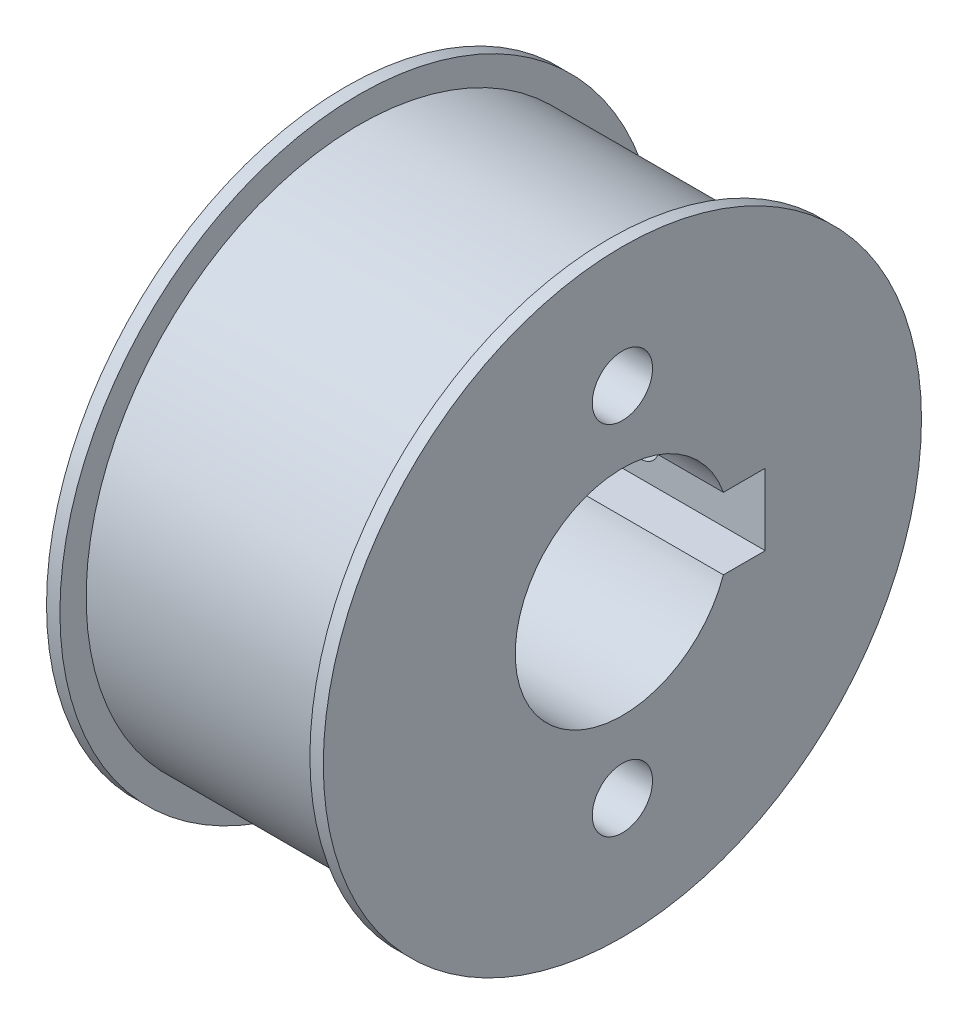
ISO-10303-21;
HEADER;
FILE_DESCRIPTION(('STEP AP214'),'2;1');
FILE_NAME('part.step','',(''),(''),'','','');
FILE_SCHEMA(('AUTOMOTIVE_DESIGN { 1 0 10303 214 1 1 1 1 }'));
ENDSEC;
DATA;
#1=APPLICATION_CONTEXT('core data for automotive mechanical design processes');
#2=APPLICATION_PROTOCOL_DEFINITION('international standard','automotive_design',2000,#1);
#3=PRODUCT_CONTEXT('',#1,'mechanical');
#4=PRODUCT('Part','Part','',(#3));
#5=PRODUCT_RELATED_PRODUCT_CATEGORY('part','',(#4));
#6=PRODUCT_DEFINITION_FORMATION('','',#4);
#7=PRODUCT_DEFINITION_CONTEXT('part definition',#1,'design');
#8=PRODUCT_DEFINITION('design','',#6,#7);
#9=PRODUCT_DEFINITION_SHAPE('','',#8);
#10=(LENGTH_UNIT() NAMED_UNIT(*) SI_UNIT(.MILLI.,.METRE.));
#11=(NAMED_UNIT(*) PLANE_ANGLE_UNIT() SI_UNIT($,.RADIAN.));
#12=(NAMED_UNIT(*) SI_UNIT($,.STERADIAN.) SOLID_ANGLE_UNIT());
#13=UNCERTAINTY_MEASURE_WITH_UNIT(LENGTH_MEASURE(1.E-05),#10,'distance_accuracy_value','');
#14=(GEOMETRIC_REPRESENTATION_CONTEXT(3) GLOBAL_UNCERTAINTY_ASSIGNED_CONTEXT((#13)) GLOBAL_UNIT_ASSIGNED_CONTEXT((#10,
#11,#12)) REPRESENTATION_CONTEXT('',''));
#15=CARTESIAN_POINT('',(0.,0.,0.));
#16=DIRECTION('',(0.,0.,1.));
#17=DIRECTION('',(1.,0.,0.));
#18=AXIS2_PLACEMENT_3D('',#15,#16,#17);
#19=CARTESIAN_POINT('',(-14.,0.,-35.));
#20=DIRECTION('',(0.,0.,1.));
#21=DIRECTION('',(1.,0.,0.));
#22=AXIS2_PLACEMENT_3D('',#19,#20,#21);
#23=CYLINDRICAL_SURFACE('',#22,2.1);
#24=CARTESIAN_POINT('',(-16.1,0.,-30.56));
#25=CARTESIAN_POINT('',(-16.0999948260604,-0.117808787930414,-30.5599990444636));
#26=CARTESIAN_POINT('',(-16.0900531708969,-0.235699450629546,-30.5593114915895));
#27=CARTESIAN_POINT('',(-16.0505376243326,-0.468223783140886,-30.5566348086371));
#28=CARTESIAN_POINT('',(-16.0209410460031,-0.582853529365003,-30.5546441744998));
#29=CARTESIAN_POINT('',(-15.9429713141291,-0.805454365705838,-30.5495864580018));
#30=CARTESIAN_POINT('',(-15.894608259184,-0.913429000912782,-30.5465199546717));
#31=CARTESIAN_POINT('',(-15.7804952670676,-1.11970013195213,-30.5396551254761));
#32=CARTESIAN_POINT('',(-15.7147492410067,-1.2179987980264,-30.5358569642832));
#33=CARTESIAN_POINT('',(-15.5676090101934,-1.40233025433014,-30.5279479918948));
#34=CARTESIAN_POINT('',(-15.4861903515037,-1.48834350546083,-30.5238366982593));
#35=CARTESIAN_POINT('',(-15.310066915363,-1.64549524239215,-30.5157689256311));
#36=CARTESIAN_POINT('',(-15.2153615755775,-1.71663309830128,-30.5118124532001));
#37=CARTESIAN_POINT('',(-15.0152397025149,-1.84207705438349,-30.5044966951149));
#38=CARTESIAN_POINT('',(-14.9098127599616,-1.89636658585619,-30.501137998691));
#39=CARTESIAN_POINT('',(-14.6913132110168,-1.9864668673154,-30.4954029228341));
#40=CARTESIAN_POINT('',(-14.5782407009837,-2.02227785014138,-30.4930265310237));
#41=CARTESIAN_POINT('',(-14.3478507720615,-2.07434937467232,-30.489528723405));
#42=CARTESIAN_POINT('',(-14.230540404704,-2.09064097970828,-30.488405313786));
#43=CARTESIAN_POINT('',(-13.9948451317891,-2.10330720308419,-30.4875341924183));
#44=CARTESIAN_POINT('',(-13.8764602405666,-2.09968208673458,-30.4877864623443));
#45=CARTESIAN_POINT('',(-13.6421884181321,-2.07264351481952,-30.4896364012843));
#46=CARTESIAN_POINT('',(-13.5262975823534,-2.04926371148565,-30.4912317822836));
#47=CARTESIAN_POINT('',(-13.30008915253,-1.98343165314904,-30.4955845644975));
#48=CARTESIAN_POINT('',(-13.1897715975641,-1.94097926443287,-30.4983419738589));
#49=CARTESIAN_POINT('',(-12.9777333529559,-1.83816903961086,-30.5047107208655));
#50=CARTESIAN_POINT('',(-12.876020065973,-1.77779598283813,-30.5083227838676));
#51=CARTESIAN_POINT('',(-12.6841585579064,-1.64086920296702,-30.5159930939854));
#52=CARTESIAN_POINT('',(-12.5940104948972,-1.56431525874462,-30.5200513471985));
#53=CARTESIAN_POINT('',(-12.4276426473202,-1.39701046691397,-30.5281668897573));
#54=CARTESIAN_POINT('',(-12.3514521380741,-1.30623050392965,-30.5322241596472));
#55=CARTESIAN_POINT('',(-12.2153881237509,-1.11315251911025,-30.5398724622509));
#56=CARTESIAN_POINT('',(-12.1555146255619,-1.01085449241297,-30.5434634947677));
#57=CARTESIAN_POINT('',(-12.0537865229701,-0.79762614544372,-30.5497750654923));
#58=CARTESIAN_POINT('',(-12.0119330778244,-0.686695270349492,-30.5524955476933));
#59=CARTESIAN_POINT('',(-11.9474529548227,-0.459358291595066,-30.556758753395));
#60=CARTESIAN_POINT('',(-11.9248260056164,-0.342952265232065,-30.5583014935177));
#61=CARTESIAN_POINT('',(-11.8994775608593,-0.108223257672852,-30.5600332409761));
#62=CARTESIAN_POINT('',(-11.8967155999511,0.0100953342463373,-30.560225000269));
#63=CARTESIAN_POINT('',(-11.9110697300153,0.245514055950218,-30.5592405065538));
#64=CARTESIAN_POINT('',(-11.9281856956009,0.362614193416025,-30.5580642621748));
#65=CARTESIAN_POINT('',(-11.9817763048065,0.59215759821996,-30.55447791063));
#66=CARTESIAN_POINT('',(-12.0182323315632,0.704605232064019,-30.5520689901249));
#67=CARTESIAN_POINT('',(-12.1094492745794,0.9217865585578,-30.5462881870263));
#68=CARTESIAN_POINT('',(-12.1642103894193,1.02652016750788,-30.5429162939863));
#69=CARTESIAN_POINT('',(-12.2905856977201,1.22548543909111,-30.5355813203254));
#70=CARTESIAN_POINT('',(-12.3622268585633,1.31969993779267,-30.5316172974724));
#71=CARTESIAN_POINT('',(-12.5202894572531,1.49477967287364,-30.5235471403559));
#72=CARTESIAN_POINT('',(-12.6067110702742,1.57564475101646,-30.5194410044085));
#73=CARTESIAN_POINT('',(-12.7920562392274,1.72186772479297,-30.5115413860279));
#74=CARTESIAN_POINT('',(-12.8910005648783,1.78719932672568,-30.5077484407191));
#75=CARTESIAN_POINT('',(-13.0984783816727,1.90032085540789,-30.5009115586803));
#76=CARTESIAN_POINT('',(-13.2070118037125,1.94811090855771,-30.4978676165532));
#77=CARTESIAN_POINT('',(-13.4304916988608,2.02474742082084,-30.4928759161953));
#78=CARTESIAN_POINT('',(-13.5454325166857,2.05361030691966,-30.4909272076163));
#79=CARTESIAN_POINT('',(-13.7785427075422,2.09162677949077,-30.4883431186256));
#80=CARTESIAN_POINT('',(-13.8967120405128,2.10078061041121,-30.4877077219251));
#81=CARTESIAN_POINT('',(-14.1326634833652,2.09911666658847,-30.4878223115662));
#82=CARTESIAN_POINT('',(-14.2504458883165,2.08834022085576,-30.488569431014));
#83=CARTESIAN_POINT('',(-14.4825244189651,2.04720744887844,-30.4913587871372));
#84=CARTESIAN_POINT('',(-14.596820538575,2.01685108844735,-30.493401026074));
#85=CARTESIAN_POINT('',(-14.8186872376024,1.93742984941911,-30.498549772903));
#86=CARTESIAN_POINT('',(-14.9262579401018,1.88836531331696,-30.5016562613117));
#87=CARTESIAN_POINT('',(-15.131640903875,1.7729257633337,-30.5085834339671));
#88=CARTESIAN_POINT('',(-15.2294533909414,1.70655115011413,-30.5124041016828));
#89=CARTESIAN_POINT('',(-15.4127537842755,1.55822162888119,-30.5203384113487));
#90=CARTESIAN_POINT('',(-15.4982172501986,1.47623654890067,-30.5244526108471));
#91=CARTESIAN_POINT('',(-15.654199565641,1.29905951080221,-30.5325054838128));
#92=CARTESIAN_POINT('',(-15.7247147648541,1.20386433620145,-30.5364441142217));
#93=CARTESIAN_POINT('',(-15.848862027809,1.00284111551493,-30.5437069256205));
#94=CARTESIAN_POINT('',(-15.9024702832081,0.896998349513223,-30.5470302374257));
#95=CARTESIAN_POINT('',(-15.9910883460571,0.677867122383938,-30.5526767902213));
#96=CARTESIAN_POINT('',(-16.026119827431,0.564587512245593,-30.5550011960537));
#97=CARTESIAN_POINT('',(-16.0675339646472,0.3755177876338,-30.5577822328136));
#98=CARTESIAN_POINT('',(-16.0796928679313,0.300948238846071,-30.5586101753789));
#99=CARTESIAN_POINT('',(-16.0959275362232,0.150930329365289,-30.5597193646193));
#100=CARTESIAN_POINT('',(-16.1000033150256,0.0754819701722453,-30.5600006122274));
#101=CARTESIAN_POINT('',(-16.1,0.,-30.56));
#102=B_SPLINE_CURVE_WITH_KNOTS('',3,(#24,#25,#26,#27,#28,#29,#30,#31,#32,#33,#34,#35,#36,#37,
#38,#39,#40,#41,#42,#43,#44,#45,#46,#47,#48,#49,#50,#51,#52,#53,#54,#55,#56,#57,#58,#59,#60,#61,
#62,#63,#64,#65,#66,#67,#68,#69,#70,#71,#72,#73,#74,#75,#76,#77,#78,#79,#80,#81,#82,#83,#84,#85,
#86,#87,#88,#89,#90,#91,#92,#93,#94,#95,#96,#97,#98,#99,#100,#101),.UNSPECIFIED.,.T.,.F.,(4,2,2,
2,2,2,2,2,2,2,2,2,2,2,2,2,2,2,2,2,2,2,2,2,2,2,2,2,2,2,2,2,2,2,2,2,2,2,4),(0.,0.353150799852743,
0.706709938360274,1.06007908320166,1.41336878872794,1.76721426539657,2.12107472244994,
2.47528207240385,2.82948495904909,3.1831234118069,3.5367571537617,3.88978969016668,
4.24282470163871,4.59616042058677,4.94950096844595,5.30357435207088,5.65764788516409,
6.01174419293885,6.36583550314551,6.71920531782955,7.07257290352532,7.42560095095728,
7.77863282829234,8.13223257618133,8.48583651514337,8.84003480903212,9.19423055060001,
9.54811847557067,9.90200201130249,10.2551525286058,10.6083036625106,10.9614483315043,
11.314584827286,11.6684109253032,12.0223233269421,12.376731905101,12.7307260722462,
12.9569958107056,13.18326516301),.UNSPECIFIED.);
#103=CARTESIAN_POINT('',(-16.1,0.,-30.56));
#104=VERTEX_POINT('',#103);
#105=EDGE_CURVE('E107',#104,#104,#102,.T.);
#106=ORIENTED_EDGE('',*,*,#105,.F.);
#107=EDGE_LOOP('',(#106));
#108=FACE_BOUND('',#107,.T.);
#109=CARTESIAN_POINT('',(-14.,0.,-16.));
#110=DIRECTION('',(0.,0.,1.));
#111=DIRECTION('',(1.,0.,0.));
#112=AXIS2_PLACEMENT_3D('',#109,#110,#111);
#113=CIRCLE('',#112,2.1);
#114=CARTESIAN_POINT('',(-11.9,0.,-16.));
#115=VERTEX_POINT('',#114);
#116=EDGE_CURVE('E36',#115,#115,#113,.F.);
#117=ORIENTED_EDGE('',*,*,#116,.F.);
#118=EDGE_LOOP('',(#117));
#119=FACE_BOUND('',#118,.T.);
#120=ADVANCED_FACE('F32',(#108,#119),#23,.F.);
#121=CARTESIAN_POINT('',(80.8466738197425,0.,0.));
#122=DIRECTION('',(1.,0.,0.));
#123=DIRECTION('',(0.,0.,-1.));
#124=AXIS2_PLACEMENT_3D('',#121,#122,#123);
#125=CYLINDRICAL_SURFACE('',#124,33.5);
#126=CARTESIAN_POINT('',(-29.5,0.,0.));
#127=DIRECTION('',(1.,0.,0.));
#128=DIRECTION('',(0.,0.,-1.));
#129=AXIS2_PLACEMENT_3D('',#126,#127,#128);
#130=CIRCLE('',#129,33.5);
#131=CARTESIAN_POINT('',(-29.5,0.,-33.5));
#132=VERTEX_POINT('',#131);
#133=EDGE_CURVE('E11',#132,#132,#130,.T.);
#134=ORIENTED_EDGE('',*,*,#133,.F.);
#135=EDGE_LOOP('',(#134));
#136=FACE_BOUND('',#135,.T.);
#137=CARTESIAN_POINT('',(-31.,0.,0.));
#138=DIRECTION('',(1.,0.,0.));
#139=DIRECTION('',(0.,0.,-1.));
#140=AXIS2_PLACEMENT_3D('',#137,#138,#139);
#141=CIRCLE('',#140,33.5);
#142=CARTESIAN_POINT('',(-31.,0.,-33.5));
#143=VERTEX_POINT('',#142);
#144=EDGE_CURVE('E176',#143,#143,#141,.T.);
#145=ORIENTED_EDGE('',*,*,#144,.T.);
#146=EDGE_LOOP('',(#145));
#147=FACE_BOUND('',#146,.T.);
#148=ADVANCED_FACE('F34',(#136,#147),#125,.T.);
#149=CARTESIAN_POINT('',(-29.5,33.5,0.));
#150=DIRECTION('',(-1.,0.,0.));
#151=DIRECTION('',(0.,0.,1.));
#152=AXIS2_PLACEMENT_3D('',#149,#150,#151);
#153=PLANE('',#152);
#154=CARTESIAN_POINT('',(-29.5,0.,0.));
#155=DIRECTION('',(1.,0.,0.));
#156=DIRECTION('',(0.,0.,-1.));
#157=AXIS2_PLACEMENT_3D('',#154,#155,#156);
#158=CIRCLE('',#157,30.56);
#159=CARTESIAN_POINT('',(-29.5,0.,-30.56));
#160=VERTEX_POINT('',#159);
#161=EDGE_CURVE('E41',#160,#160,#158,.T.);
#162=ORIENTED_EDGE('',*,*,#161,.F.);
#163=EDGE_LOOP('',(#162));
#164=FACE_BOUND('',#163,.T.);
#165=ORIENTED_EDGE('',*,*,#133,.T.);
#166=EDGE_LOOP('',(#165));
#167=FACE_BOUND('',#166,.T.);
#168=ADVANCED_FACE('F153',(#164,#167),#153,.F.);
#169=CARTESIAN_POINT('',(80.8466738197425,0.,0.));
#170=DIRECTION('',(1.,0.,0.));
#171=DIRECTION('',(0.,0.,-1.));
#172=AXIS2_PLACEMENT_3D('',#169,#170,#171);
#173=CYLINDRICAL_SURFACE('',#172,30.56);
#174=ORIENTED_EDGE('',*,*,#105,.T.);
#175=EDGE_LOOP('',(#174));
#176=FACE_BOUND('',#175,.T.);
#177=CARTESIAN_POINT('',(-1.5,0.,0.));
#178=DIRECTION('',(1.,0.,0.));
#179=DIRECTION('',(0.,0.,-1.));
#180=AXIS2_PLACEMENT_3D('',#177,#178,#179);
#181=CIRCLE('',#180,30.56);
#182=CARTESIAN_POINT('',(-1.5,0.,-30.56));
#183=VERTEX_POINT('',#182);
#184=EDGE_CURVE('E161',#183,#183,#181,.T.);
#185=ORIENTED_EDGE('',*,*,#184,.F.);
#186=EDGE_LOOP('',(#185));
#187=FACE_BOUND('',#186,.T.);
#188=ORIENTED_EDGE('',*,*,#161,.T.);
#189=EDGE_LOOP('',(#188));
#190=FACE_BOUND('',#189,.T.);
#191=ADVANCED_FACE('F116',(#176,#187,#190),#173,.T.);
#192=CARTESIAN_POINT('',(-1.5,30.56,0.));
#193=DIRECTION('',(1.,0.,0.));
#194=DIRECTION('',(0.,0.,-1.));
#195=AXIS2_PLACEMENT_3D('',#192,#193,#194);
#196=PLANE('',#195);
#197=CARTESIAN_POINT('',(-1.5,0.,0.));
#198=DIRECTION('',(1.,0.,0.));
#199=DIRECTION('',(0.,0.,-1.));
#200=AXIS2_PLACEMENT_3D('',#197,#198,#199);
#201=CIRCLE('',#200,33.5);
#202=CARTESIAN_POINT('',(-1.5,0.,-33.5));
#203=VERTEX_POINT('',#202);
#204=EDGE_CURVE('E158',#203,#203,#201,.T.);
#205=ORIENTED_EDGE('',*,*,#204,.F.);
#206=EDGE_LOOP('',(#205));
#207=FACE_BOUND('',#206,.T.);
#208=ORIENTED_EDGE('',*,*,#184,.T.);
#209=EDGE_LOOP('',(#208));
#210=FACE_BOUND('',#209,.T.);
#211=ADVANCED_FACE('F146',(#207,#210),#196,.F.);
#212=CARTESIAN_POINT('',(80.8466738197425,0.,0.));
#213=DIRECTION('',(1.,0.,0.));
#214=DIRECTION('',(0.,0.,-1.));
#215=AXIS2_PLACEMENT_3D('',#212,#213,#214);
#216=CYLINDRICAL_SURFACE('',#215,33.5);
#217=CARTESIAN_POINT('',(0.,0.,0.));
#218=DIRECTION('',(1.,0.,0.));
#219=DIRECTION('',(0.,0.,-1.));
#220=AXIS2_PLACEMENT_3D('',#217,#218,#219);
#221=CIRCLE('',#220,33.5);
#222=CARTESIAN_POINT('',(0.,0.,-33.5));
#223=VERTEX_POINT('',#222);
#224=EDGE_CURVE('E166',#223,#223,#221,.T.);
#225=ORIENTED_EDGE('',*,*,#224,.F.);
#226=EDGE_LOOP('',(#225));
#227=FACE_BOUND('',#226,.T.);
#228=ORIENTED_EDGE('',*,*,#204,.T.);
#229=EDGE_LOOP('',(#228));
#230=FACE_BOUND('',#229,.T.);
#231=ADVANCED_FACE('F143',(#227,#230),#216,.T.);
#232=CARTESIAN_POINT('',(0.,33.5,0.));
#233=DIRECTION('',(-1.,0.,0.));
#234=DIRECTION('',(0.,0.,1.));
#235=AXIS2_PLACEMENT_3D('',#232,#233,#234);
#236=PLANE('',#235);
#237=CARTESIAN_POINT('',(0.,-20.,1.40512601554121E-13));
#238=DIRECTION('',(1.,0.,0.));
#239=DIRECTION('',(0.,0.,1.));
#240=AXIS2_PLACEMENT_3D('',#237,#238,#239);
#241=CIRCLE('',#240,3.375);
#242=CARTESIAN_POINT('',(0.,-20.,3.37500000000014));
#243=VERTEX_POINT('',#242);
#244=EDGE_CURVE('E114',#243,#243,#241,.T.);
#245=ORIENTED_EDGE('',*,*,#244,.F.);
#246=EDGE_LOOP('',(#245));
#247=FACE_BOUND('',#246,.T.);
#248=CARTESIAN_POINT('',(0.,20.,0.));
#249=DIRECTION('',(1.,0.,0.));
#250=DIRECTION('',(0.,0.,-1.));
#251=AXIS2_PLACEMENT_3D('',#248,#249,#250);
#252=CIRCLE('',#251,3.375);
#253=CARTESIAN_POINT('',(0.,20.,-3.375));
#254=VERTEX_POINT('',#253);
#255=EDGE_CURVE('E182',#254,#254,#252,.T.);
#256=ORIENTED_EDGE('',*,*,#255,.F.);
#257=EDGE_LOOP('',(#256));
#258=FACE_BOUND('',#257,.T.);
#259=DIRECTION('',(0.,-1.,0.));
#260=VECTOR('',#259,1.);
#261=CARTESIAN_POINT('',(0.,4.,-16.));
#262=LINE('',#261,#260);
#263=CARTESIAN_POINT('',(0.,4.,-16.));
#264=VERTEX_POINT('',#263);
#265=CARTESIAN_POINT('',(0.,-4.,-16.));
#266=VERTEX_POINT('',#265);
#267=EDGE_CURVE('E82',#264,#266,#262,.T.);
#268=ORIENTED_EDGE('',*,*,#267,.T.);
#269=DIRECTION('',(0.,0.,-1.));
#270=VECTOR('',#269,1.);
#271=CARTESIAN_POINT('',(0.,-4.,-7.51274209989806));
#272=LINE('',#271,#270);
#273=CARTESIAN_POINT('',(0.,-4.,-11.3137084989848));
#274=VERTEX_POINT('',#273);
#275=EDGE_CURVE('E72',#274,#266,#272,.T.);
#276=ORIENTED_EDGE('',*,*,#275,.F.);
#277=CARTESIAN_POINT('',(0.,0.,0.));
#278=DIRECTION('',(1.,0.,0.));
#279=DIRECTION('',(0.,0.,-1.));
#280=AXIS2_PLACEMENT_3D('',#277,#278,#279);
#281=CIRCLE('',#280,12.);
#282=CARTESIAN_POINT('',(0.,4.,-11.3137084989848));
#283=VERTEX_POINT('',#282);
#284=EDGE_CURVE('E171',#283,#274,#281,.T.);
#285=ORIENTED_EDGE('',*,*,#284,.F.);
#286=DIRECTION('',(0.,0.,1.));
#287=VECTOR('',#286,1.);
#288=CARTESIAN_POINT('',(0.,4.,-16.));
#289=LINE('',#288,#287);
#290=EDGE_CURVE('E81',#264,#283,#289,.T.);
#291=ORIENTED_EDGE('',*,*,#290,.F.);
#292=EDGE_LOOP('',(#268,#276,#285,#291));
#293=FACE_BOUND('',#292,.T.);
#294=ORIENTED_EDGE('',*,*,#224,.T.);
#295=EDGE_LOOP('',(#294));
#296=FACE_BOUND('',#295,.T.);
#297=ADVANCED_FACE('F94',(#247,#258,#293,#296),#236,.F.);
#298=CARTESIAN_POINT('',(80.8466738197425,0.,0.));
#299=DIRECTION('',(1.,0.,0.));
#300=DIRECTION('',(0.,0.,-1.));
#301=AXIS2_PLACEMENT_3D('',#298,#299,#300);
#302=CYLINDRICAL_SURFACE('',#301,12.);
#303=ORIENTED_EDGE('',*,*,#284,.T.);
#304=DIRECTION('',(1.,0.,0.));
#305=VECTOR('',#304,1.);
#306=CARTESIAN_POINT('',(80.8466738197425,-4.,-11.3137084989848));
#307=LINE('',#306,#305);
#308=CARTESIAN_POINT('',(-31.,-4.,-11.3137084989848));
#309=VERTEX_POINT('',#308);
#310=EDGE_CURVE('E56',#274,#309,#307,.F.);
#311=ORIENTED_EDGE('',*,*,#310,.T.);
#312=CARTESIAN_POINT('',(-31.,0.,0.));
#313=DIRECTION('',(1.,0.,0.));
#314=DIRECTION('',(0.,0.,-1.));
#315=AXIS2_PLACEMENT_3D('',#312,#313,#314);
#316=CIRCLE('',#315,12.);
#317=CARTESIAN_POINT('',(-31.,4.,-11.3137084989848));
#318=VERTEX_POINT('',#317);
#319=EDGE_CURVE('E173',#318,#309,#316,.T.);
#320=ORIENTED_EDGE('',*,*,#319,.F.);
#321=DIRECTION('',(1.,0.,0.));
#322=VECTOR('',#321,1.);
#323=CARTESIAN_POINT('',(80.8466738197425,4.,-11.3137084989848));
#324=LINE('',#323,#322);
#325=EDGE_CURVE('E48',#318,#283,#324,.T.);
#326=ORIENTED_EDGE('',*,*,#325,.T.);
#327=EDGE_LOOP('',(#303,#311,#320,#326));
#328=FACE_BOUND('',#327,.T.);
#329=ADVANCED_FACE('F136',(#328),#302,.F.);
#330=CARTESIAN_POINT('',(-31.,33.5,0.));
#331=DIRECTION('',(-1.,0.,0.));
#332=DIRECTION('',(0.,0.,1.));
#333=AXIS2_PLACEMENT_3D('',#330,#331,#332);
#334=PLANE('',#333);
#335=DIRECTION('',(0.,0.,-1.));
#336=VECTOR('',#335,1.);
#337=CARTESIAN_POINT('',(-31.,-4.,-7.51274209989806));
#338=LINE('',#337,#336);
#339=CARTESIAN_POINT('',(-31.,-4.,-16.));
#340=VERTEX_POINT('',#339);
#341=EDGE_CURVE('E100',#309,#340,#338,.T.);
#342=ORIENTED_EDGE('',*,*,#341,.T.);
#343=DIRECTION('',(0.,-1.,0.));
#344=VECTOR('',#343,1.);
#345=CARTESIAN_POINT('',(-31.,4.,-16.));
#346=LINE('',#345,#344);
#347=CARTESIAN_POINT('',(-31.,4.,-16.));
#348=VERTEX_POINT('',#347);
#349=EDGE_CURVE('E90',#348,#340,#346,.T.);
#350=ORIENTED_EDGE('',*,*,#349,.F.);
#351=DIRECTION('',(0.,0.,1.));
#352=VECTOR('',#351,1.);
#353=CARTESIAN_POINT('',(-31.,4.,-16.));
#354=LINE('',#353,#352);
#355=EDGE_CURVE('E102',#348,#318,#354,.T.);
#356=ORIENTED_EDGE('',*,*,#355,.T.);
#357=ORIENTED_EDGE('',*,*,#319,.T.);
#358=EDGE_LOOP('',(#342,#350,#356,#357));
#359=FACE_BOUND('',#358,.T.);
#360=CARTESIAN_POINT('',(-31.,-20.,1.40512601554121E-13));
#361=DIRECTION('',(1.,0.,0.));
#362=DIRECTION('',(0.,0.,1.));
#363=AXIS2_PLACEMENT_3D('',#360,#361,#362);
#364=CIRCLE('',#363,3.375);
#365=CARTESIAN_POINT('',(-31.,-20.,3.37500000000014));
#366=VERTEX_POINT('',#365);
#367=EDGE_CURVE('E184',#366,#366,#364,.T.);
#368=ORIENTED_EDGE('',*,*,#367,.T.);
#369=EDGE_LOOP('',(#368));
#370=FACE_BOUND('',#369,.T.);
#371=CARTESIAN_POINT('',(-31.,20.,0.));
#372=DIRECTION('',(1.,0.,0.));
#373=DIRECTION('',(0.,0.,-1.));
#374=AXIS2_PLACEMENT_3D('',#371,#372,#373);
#375=CIRCLE('',#374,3.375);
#376=CARTESIAN_POINT('',(-31.,20.,-3.375));
#377=VERTEX_POINT('',#376);
#378=EDGE_CURVE('E179',#377,#377,#375,.T.);
#379=ORIENTED_EDGE('',*,*,#378,.T.);
#380=EDGE_LOOP('',(#379));
#381=FACE_BOUND('',#380,.T.);
#382=ORIENTED_EDGE('',*,*,#144,.F.);
#383=EDGE_LOOP('',(#382));
#384=FACE_BOUND('',#383,.T.);
#385=ADVANCED_FACE('F132',(#359,#370,#381,#384),#334,.T.);
#386=CARTESIAN_POINT('',(-31.,20.,0.));
#387=DIRECTION('',(1.,0.,0.));
#388=DIRECTION('',(0.,0.,-1.));
#389=AXIS2_PLACEMENT_3D('',#386,#387,#388);
#390=CYLINDRICAL_SURFACE('',#389,3.375);
#391=ORIENTED_EDGE('',*,*,#378,.F.);
#392=EDGE_LOOP('',(#391));
#393=FACE_BOUND('',#392,.T.);
#394=ORIENTED_EDGE('',*,*,#255,.T.);
#395=EDGE_LOOP('',(#394));
#396=FACE_BOUND('',#395,.T.);
#397=ADVANCED_FACE('F128',(#393,#396),#390,.F.);
#398=CARTESIAN_POINT('',(-31.,-20.,1.40512601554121E-13));
#399=DIRECTION('',(1.,0.,0.));
#400=DIRECTION('',(0.,0.,-1.));
#401=AXIS2_PLACEMENT_3D('',#398,#399,#400);
#402=CYLINDRICAL_SURFACE('',#401,3.375);
#403=ORIENTED_EDGE('',*,*,#367,.F.);
#404=EDGE_LOOP('',(#403));
#405=FACE_BOUND('',#404,.T.);
#406=ORIENTED_EDGE('',*,*,#244,.T.);
#407=EDGE_LOOP('',(#406));
#408=FACE_BOUND('',#407,.T.);
#409=ADVANCED_FACE('F125',(#405,#408),#402,.F.);
#410=CARTESIAN_POINT('',(-31.,-4.,-7.51274209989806));
#411=DIRECTION('',(0.,-1.,0.));
#412=DIRECTION('',(0.,0.,-1.));
#413=AXIS2_PLACEMENT_3D('',#410,#411,#412);
#414=PLANE('',#413);
#415=ORIENTED_EDGE('',*,*,#275,.T.);
#416=DIRECTION('',(1.,0.,0.));
#417=VECTOR('',#416,1.);
#418=CARTESIAN_POINT('',(-31.,-4.,-16.));
#419=LINE('',#418,#417);
#420=EDGE_CURVE('E75',#340,#266,#419,.T.);
#421=ORIENTED_EDGE('',*,*,#420,.F.);
#422=ORIENTED_EDGE('',*,*,#341,.F.);
#423=ORIENTED_EDGE('',*,*,#310,.F.);
#424=EDGE_LOOP('',(#415,#421,#422,#423));
#425=FACE_BOUND('',#424,.T.);
#426=ADVANCED_FACE('F74',(#425),#414,.F.);
#427=CARTESIAN_POINT('',(-31.,4.,-16.));
#428=DIRECTION('',(0.,1.,0.));
#429=DIRECTION('',(0.,0.,1.));
#430=AXIS2_PLACEMENT_3D('',#427,#428,#429);
#431=PLANE('',#430);
#432=ORIENTED_EDGE('',*,*,#355,.F.);
#433=DIRECTION('',(1.,0.,0.));
#434=VECTOR('',#433,1.);
#435=CARTESIAN_POINT('',(-31.,4.,-16.));
#436=LINE('',#435,#434);
#437=EDGE_CURVE('E92',#348,#264,#436,.T.);
#438=ORIENTED_EDGE('',*,*,#437,.T.);
#439=ORIENTED_EDGE('',*,*,#290,.T.);
#440=ORIENTED_EDGE('',*,*,#325,.F.);
#441=EDGE_LOOP('',(#432,#438,#439,#440));
#442=FACE_BOUND('',#441,.T.);
#443=ADVANCED_FACE('F265',(#442),#431,.F.);
#444=CARTESIAN_POINT('',(-31.,4.,-16.));
#445=DIRECTION('',(0.,0.,1.));
#446=DIRECTION('',(1.,0.,0.));
#447=AXIS2_PLACEMENT_3D('',#444,#445,#446);
#448=PLANE('',#447);
#449=ORIENTED_EDGE('',*,*,#420,.T.);
#450=ORIENTED_EDGE('',*,*,#267,.F.);
#451=ORIENTED_EDGE('',*,*,#437,.F.);
#452=ORIENTED_EDGE('',*,*,#349,.T.);
#453=EDGE_LOOP('',(#449,#450,#451,#452));
#454=FACE_BOUND('',#453,.T.);
#455=ORIENTED_EDGE('',*,*,#116,.T.);
#456=EDGE_LOOP('',(#455));
#457=FACE_BOUND('',#456,.T.);
#458=ADVANCED_FACE('F86',(#454,#457),#448,.T.);
#459=CLOSED_SHELL('',(#120,#148,#168,#191,#211,#231,#297,#329,#385,#397,#409,#426,#443,#458));
#460=MANIFOLD_SOLID_BREP('B2',#459);
#461=ADVANCED_BREP_SHAPE_REPRESENTATION('',(#18,#460),#14);
#462=SHAPE_DEFINITION_REPRESENTATION(#9,#461);
ENDSEC;
END-ISO-10303-21;
